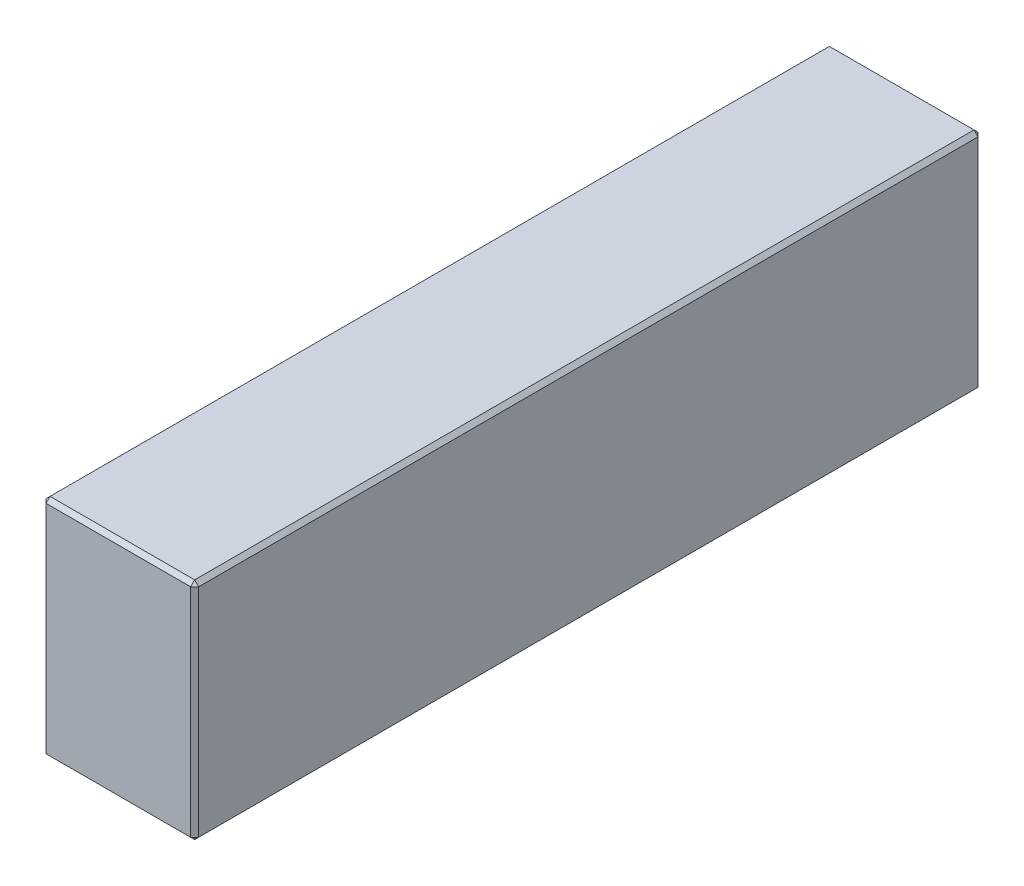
ISO-10303-21;
HEADER;
FILE_DESCRIPTION(('STEP AP214'),'2;1');
FILE_NAME('part.step','',(''),(''),'','','');
FILE_SCHEMA(('AUTOMOTIVE_DESIGN { 1 0 10303 214 1 1 1 1 }'));
ENDSEC;
DATA;
#1=APPLICATION_CONTEXT('core data for automotive mechanical design processes');
#2=APPLICATION_PROTOCOL_DEFINITION('international standard','automotive_design',2000,#1);
#3=PRODUCT_CONTEXT('',#1,'mechanical');
#4=PRODUCT('Part','Part','',(#3));
#5=PRODUCT_RELATED_PRODUCT_CATEGORY('part','',(#4));
#6=PRODUCT_DEFINITION_FORMATION('','',#4);
#7=PRODUCT_DEFINITION_CONTEXT('part definition',#1,'design');
#8=PRODUCT_DEFINITION('design','',#6,#7);
#9=PRODUCT_DEFINITION_SHAPE('','',#8);
#10=(LENGTH_UNIT() NAMED_UNIT(*) SI_UNIT(.MILLI.,.METRE.));
#11=(NAMED_UNIT(*) PLANE_ANGLE_UNIT() SI_UNIT($,.RADIAN.));
#12=(NAMED_UNIT(*) SI_UNIT($,.STERADIAN.) SOLID_ANGLE_UNIT());
#13=UNCERTAINTY_MEASURE_WITH_UNIT(LENGTH_MEASURE(1.E-05),#10,'distance_accuracy_value','');
#14=(GEOMETRIC_REPRESENTATION_CONTEXT(3) GLOBAL_UNCERTAINTY_ASSIGNED_CONTEXT((#13)) GLOBAL_UNIT_ASSIGNED_CONTEXT((#10,
#11,#12)) REPRESENTATION_CONTEXT('',''));
#15=CARTESIAN_POINT('',(0.,0.,0.));
#16=DIRECTION('',(0.,0.,1.));
#17=DIRECTION('',(1.,0.,0.));
#18=AXIS2_PLACEMENT_3D('',#15,#16,#17);
#19=CARTESIAN_POINT('',(-19.,56.,98.));
#20=DIRECTION('',(1.,0.,0.));
#21=DIRECTION('',(0.,0.,-1.));
#22=AXIS2_PLACEMENT_3D('',#19,#20,#21);
#23=PLANE('',#22);
#24=DIRECTION('',(0.,-1.,0.));
#25=VECTOR('',#24,1.);
#26=CARTESIAN_POINT('',(-19.,56.,-97.));
#27=LINE('',#26,#25);
#28=CARTESIAN_POINT('',(-19.,55.,-97.));
#29=VERTEX_POINT('',#28);
#30=CARTESIAN_POINT('',(-19.,1.00000000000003,-97.));
#31=VERTEX_POINT('',#30);
#32=EDGE_CURVE('E115',#29,#31,#27,.T.);
#33=ORIENTED_EDGE('',*,*,#32,.T.);
#34=DIRECTION('',(0.,0.,1.));
#35=VECTOR('',#34,1.);
#36=CARTESIAN_POINT('',(-19.,1.00000000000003,98.));
#37=LINE('',#36,#35);
#38=CARTESIAN_POINT('',(-19.,1.00000000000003,97.));
#39=VERTEX_POINT('',#38);
#40=EDGE_CURVE('E111',#31,#39,#37,.T.);
#41=ORIENTED_EDGE('',*,*,#40,.T.);
#42=DIRECTION('',(0.,1.,0.));
#43=VECTOR('',#42,1.);
#44=CARTESIAN_POINT('',(-19.,56.,97.));
#45=LINE('',#44,#43);
#46=CARTESIAN_POINT('',(-19.,55.,97.));
#47=VERTEX_POINT('',#46);
#48=EDGE_CURVE('E104',#39,#47,#45,.T.);
#49=ORIENTED_EDGE('',*,*,#48,.T.);
#50=DIRECTION('',(0.,0.,-1.));
#51=VECTOR('',#50,1.);
#52=CARTESIAN_POINT('',(-19.,55.,-98.));
#53=LINE('',#52,#51);
#54=EDGE_CURVE('E108',#47,#29,#53,.T.);
#55=ORIENTED_EDGE('',*,*,#54,.T.);
#56=EDGE_LOOP('',(#33,#41,#49,#55));
#57=FACE_BOUND('',#56,.T.);
#58=ADVANCED_FACE('F16',(#57),#23,.F.);
#59=CARTESIAN_POINT('',(19.,56.,98.));
#60=DIRECTION('',(0.,0.,-1.));
#61=DIRECTION('',(-1.,0.,0.));
#62=AXIS2_PLACEMENT_3D('',#59,#60,#61);
#63=PLANE('',#62);
#64=DIRECTION('',(-1.,0.,0.));
#65=VECTOR('',#64,1.);
#66=CARTESIAN_POINT('',(-19.,55.,98.));
#67=LINE('',#66,#65);
#68=CARTESIAN_POINT('',(18.,55.,98.));
#69=VERTEX_POINT('',#68);
#70=CARTESIAN_POINT('',(-18.,55.,98.));
#71=VERTEX_POINT('',#70);
#72=EDGE_CURVE('E165',#69,#71,#67,.T.);
#73=ORIENTED_EDGE('',*,*,#72,.T.);
#74=DIRECTION('',(0.,-1.,0.));
#75=VECTOR('',#74,1.);
#76=CARTESIAN_POINT('',(-18.,56.,98.));
#77=LINE('',#76,#75);
#78=CARTESIAN_POINT('',(-18.,1.,98.));
#79=VERTEX_POINT('',#78);
#80=EDGE_CURVE('E123',#71,#79,#77,.T.);
#81=ORIENTED_EDGE('',*,*,#80,.T.);
#82=DIRECTION('',(1.,0.,0.));
#83=VECTOR('',#82,1.);
#84=CARTESIAN_POINT('',(19.,1.,98.));
#85=LINE('',#84,#83);
#86=CARTESIAN_POINT('',(18.,1.,98.));
#87=VERTEX_POINT('',#86);
#88=EDGE_CURVE('E169',#79,#87,#85,.T.);
#89=ORIENTED_EDGE('',*,*,#88,.T.);
#90=DIRECTION('',(0.,1.,0.));
#91=VECTOR('',#90,1.);
#92=CARTESIAN_POINT('',(18.,56.,98.));
#93=LINE('',#92,#91);
#94=EDGE_CURVE('E167',#87,#69,#93,.T.);
#95=ORIENTED_EDGE('',*,*,#94,.T.);
#96=EDGE_LOOP('',(#73,#81,#89,#95));
#97=FACE_BOUND('',#96,.T.);
#98=ADVANCED_FACE('F276',(#97),#63,.F.);
#99=CARTESIAN_POINT('',(19.,56.,98.));
#100=DIRECTION('',(-1.,0.,0.));
#101=DIRECTION('',(0.,0.,1.));
#102=AXIS2_PLACEMENT_3D('',#99,#100,#101);
#103=PLANE('',#102);
#104=DIRECTION('',(0.,0.,-1.));
#105=VECTOR('',#104,1.);
#106=CARTESIAN_POINT('',(19.,1.,98.));
#107=LINE('',#106,#105);
#108=CARTESIAN_POINT('',(19.,1.,97.));
#109=VERTEX_POINT('',#108);
#110=CARTESIAN_POINT('',(19.,1.,-97.));
#111=VERTEX_POINT('',#110);
#112=EDGE_CURVE('E160',#109,#111,#107,.T.);
#113=ORIENTED_EDGE('',*,*,#112,.T.);
#114=DIRECTION('',(0.,1.,0.));
#115=VECTOR('',#114,1.);
#116=CARTESIAN_POINT('',(19.,56.,-97.));
#117=LINE('',#116,#115);
#118=CARTESIAN_POINT('',(19.,55.,-97.));
#119=VERTEX_POINT('',#118);
#120=EDGE_CURVE('E162',#111,#119,#117,.T.);
#121=ORIENTED_EDGE('',*,*,#120,.T.);
#122=DIRECTION('',(0.,0.,1.));
#123=VECTOR('',#122,1.);
#124=CARTESIAN_POINT('',(19.,55.,98.));
#125=LINE('',#124,#123);
#126=CARTESIAN_POINT('',(19.,55.,97.));
#127=VERTEX_POINT('',#126);
#128=EDGE_CURVE('E156',#119,#127,#125,.T.);
#129=ORIENTED_EDGE('',*,*,#128,.T.);
#130=DIRECTION('',(0.,-1.,0.));
#131=VECTOR('',#130,1.);
#132=CARTESIAN_POINT('',(19.,56.,97.));
#133=LINE('',#132,#131);
#134=EDGE_CURVE('E158',#127,#109,#133,.T.);
#135=ORIENTED_EDGE('',*,*,#134,.T.);
#136=EDGE_LOOP('',(#113,#121,#129,#135));
#137=FACE_BOUND('',#136,.T.);
#138=ADVANCED_FACE('F255',(#137),#103,.F.);
#139=CARTESIAN_POINT('',(19.,56.,-98.));
#140=DIRECTION('',(0.,0.,1.));
#141=DIRECTION('',(1.,0.,0.));
#142=AXIS2_PLACEMENT_3D('',#139,#140,#141);
#143=PLANE('',#142);
#144=DIRECTION('',(0.,-1.,0.));
#145=VECTOR('',#144,1.);
#146=CARTESIAN_POINT('',(18.,56.,-98.));
#147=LINE('',#146,#145);
#148=CARTESIAN_POINT('',(18.,55.,-98.));
#149=VERTEX_POINT('',#148);
#150=CARTESIAN_POINT('',(18.,1.,-98.));
#151=VERTEX_POINT('',#150);
#152=EDGE_CURVE('E149',#149,#151,#147,.T.);
#153=ORIENTED_EDGE('',*,*,#152,.T.);
#154=DIRECTION('',(-1.,0.,0.));
#155=VECTOR('',#154,1.);
#156=CARTESIAN_POINT('',(19.,1.,-98.));
#157=LINE('',#156,#155);
#158=CARTESIAN_POINT('',(-18.,1.,-98.));
#159=VERTEX_POINT('',#158);
#160=EDGE_CURVE('E154',#151,#159,#157,.T.);
#161=ORIENTED_EDGE('',*,*,#160,.T.);
#162=DIRECTION('',(0.,1.,0.));
#163=VECTOR('',#162,1.);
#164=CARTESIAN_POINT('',(-18.,56.,-98.));
#165=LINE('',#164,#163);
#166=CARTESIAN_POINT('',(-18.,55.,-98.));
#167=VERTEX_POINT('',#166);
#168=EDGE_CURVE('E151',#159,#167,#165,.T.);
#169=ORIENTED_EDGE('',*,*,#168,.T.);
#170=DIRECTION('',(1.,0.,0.));
#171=VECTOR('',#170,1.);
#172=CARTESIAN_POINT('',(19.,55.,-98.));
#173=LINE('',#172,#171);
#174=EDGE_CURVE('E147',#167,#149,#173,.T.);
#175=ORIENTED_EDGE('',*,*,#174,.T.);
#176=EDGE_LOOP('',(#153,#161,#169,#175));
#177=FACE_BOUND('',#176,.T.);
#178=ADVANCED_FACE('F285',(#177),#143,.F.);
#179=CARTESIAN_POINT('',(0.,56.,0.));
#180=DIRECTION('',(0.,1.,0.));
#181=DIRECTION('',(0.,0.,1.));
#182=AXIS2_PLACEMENT_3D('',#179,#180,#181);
#183=PLANE('',#182);
#184=DIRECTION('',(0.,0.,-1.));
#185=VECTOR('',#184,1.);
#186=CARTESIAN_POINT('',(18.,56.,-98.));
#187=LINE('',#186,#185);
#188=CARTESIAN_POINT('',(18.,56.,97.));
#189=VERTEX_POINT('',#188);
#190=CARTESIAN_POINT('',(18.,56.,-97.));
#191=VERTEX_POINT('',#190);
#192=EDGE_CURVE('E25',#189,#191,#187,.T.);
#193=ORIENTED_EDGE('',*,*,#192,.T.);
#194=DIRECTION('',(-1.,0.,0.));
#195=VECTOR('',#194,1.);
#196=CARTESIAN_POINT('',(-19.,56.,-97.));
#197=LINE('',#196,#195);
#198=CARTESIAN_POINT('',(-18.,56.,-97.));
#199=VERTEX_POINT('',#198);
#200=EDGE_CURVE('E10',#191,#199,#197,.T.);
#201=ORIENTED_EDGE('',*,*,#200,.T.);
#202=DIRECTION('',(0.,0.,1.));
#203=VECTOR('',#202,1.);
#204=CARTESIAN_POINT('',(-18.,56.,98.));
#205=LINE('',#204,#203);
#206=CARTESIAN_POINT('',(-18.,56.,97.));
#207=VERTEX_POINT('',#206);
#208=EDGE_CURVE('E181',#199,#207,#205,.T.);
#209=ORIENTED_EDGE('',*,*,#208,.T.);
#210=DIRECTION('',(1.,0.,0.));
#211=VECTOR('',#210,1.);
#212=CARTESIAN_POINT('',(19.,56.,97.));
#213=LINE('',#212,#211);
#214=EDGE_CURVE('E36',#207,#189,#213,.T.);
#215=ORIENTED_EDGE('',*,*,#214,.T.);
#216=EDGE_LOOP('',(#193,#201,#209,#215));
#217=FACE_BOUND('',#216,.T.);
#218=ADVANCED_FACE('F351',(#217),#183,.T.);
#219=CARTESIAN_POINT('',(0.,0.,0.));
#220=DIRECTION('',(0.,1.,0.));
#221=DIRECTION('',(0.,0.,1.));
#222=AXIS2_PLACEMENT_3D('',#219,#220,#221);
#223=PLANE('',#222);
#224=DIRECTION('',(0.,0.,1.));
#225=VECTOR('',#224,1.);
#226=CARTESIAN_POINT('',(18.,0.,0.));
#227=LINE('',#226,#225);
#228=CARTESIAN_POINT('',(18.,0.,-97.));
#229=VERTEX_POINT('',#228);
#230=CARTESIAN_POINT('',(18.,0.,97.));
#231=VERTEX_POINT('',#230);
#232=EDGE_CURVE('E172',#229,#231,#227,.T.);
#233=ORIENTED_EDGE('',*,*,#232,.T.);
#234=DIRECTION('',(-1.,0.,0.));
#235=VECTOR('',#234,1.);
#236=CARTESIAN_POINT('',(0.,0.,97.));
#237=LINE('',#236,#235);
#238=CARTESIAN_POINT('',(-18.,0.,97.));
#239=VERTEX_POINT('',#238);
#240=EDGE_CURVE('E178',#231,#239,#237,.T.);
#241=ORIENTED_EDGE('',*,*,#240,.T.);
#242=DIRECTION('',(0.,0.,-1.));
#243=VECTOR('',#242,1.);
#244=CARTESIAN_POINT('',(-18.,0.,0.));
#245=LINE('',#244,#243);
#246=CARTESIAN_POINT('',(-18.,0.,-97.));
#247=VERTEX_POINT('',#246);
#248=EDGE_CURVE('E176',#239,#247,#245,.T.);
#249=ORIENTED_EDGE('',*,*,#248,.T.);
#250=DIRECTION('',(1.,0.,0.));
#251=VECTOR('',#250,1.);
#252=CARTESIAN_POINT('',(0.,0.,-97.));
#253=LINE('',#252,#251);
#254=EDGE_CURVE('E174',#247,#229,#253,.T.);
#255=ORIENTED_EDGE('',*,*,#254,.T.);
#256=EDGE_LOOP('',(#233,#241,#249,#255));
#257=FACE_BOUND('',#256,.T.);
#258=ADVANCED_FACE('F247',(#257),#223,.F.);
#259=CARTESIAN_POINT('',(19.,56.,97.));
#260=DIRECTION('',(-0.707106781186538,0.,-0.707106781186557));
#261=DIRECTION('',(0.,-1.,0.));
#262=AXIS2_PLACEMENT_3D('',#259,#260,#261);
#263=PLANE('',#262);
#264=DIRECTION('',(-0.707106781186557,0.,0.707106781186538));
#265=VECTOR('',#264,1.);
#266=CARTESIAN_POINT('',(18.,55.,98.));
#267=LINE('',#266,#265);
#268=EDGE_CURVE('E20',#69,#127,#267,.F.);
#269=ORIENTED_EDGE('',*,*,#268,.F.);
#270=ORIENTED_EDGE('',*,*,#94,.F.);
#271=DIRECTION('',(0.707106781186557,0.,-0.707106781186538));
#272=VECTOR('',#271,1.);
#273=CARTESIAN_POINT('',(18.,1.,98.));
#274=LINE('',#273,#272);
#275=EDGE_CURVE('E143',#109,#87,#274,.F.);
#276=ORIENTED_EDGE('',*,*,#275,.F.);
#277=ORIENTED_EDGE('',*,*,#134,.F.);
#278=EDGE_LOOP('',(#269,#270,#276,#277));
#279=FACE_BOUND('',#278,.T.);
#280=ADVANCED_FACE('F18',(#279),#263,.F.);
#281=CARTESIAN_POINT('',(18.,55.,98.));
#282=DIRECTION('',(0.577350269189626,0.57735026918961,0.577350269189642));
#283=DIRECTION('',(0.707106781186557,0.,-0.707106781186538));
#284=AXIS2_PLACEMENT_3D('',#281,#282,#283);
#285=PLANE('',#284);
#286=DIRECTION('',(0.,-0.707106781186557,0.707106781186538));
#287=VECTOR('',#286,1.);
#288=CARTESIAN_POINT('',(18.,55.,98.));
#289=LINE('',#288,#287);
#290=EDGE_CURVE('E227',#69,#189,#289,.F.);
#291=ORIENTED_EDGE('',*,*,#290,.F.);
#292=ORIENTED_EDGE('',*,*,#268,.T.);
#293=DIRECTION('',(-0.707106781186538,0.707106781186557,0.));
#294=VECTOR('',#293,1.);
#295=CARTESIAN_POINT('',(18.5,55.5,97.));
#296=LINE('',#295,#294);
#297=EDGE_CURVE('E229',#189,#127,#296,.F.);
#298=ORIENTED_EDGE('',*,*,#297,.F.);
#299=EDGE_LOOP('',(#291,#292,#298));
#300=FACE_BOUND('',#299,.T.);
#301=ADVANCED_FACE('F271',(#300),#285,.T.);
#302=CARTESIAN_POINT('',(18.,1.,98.));
#303=DIRECTION('',(0.57735026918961,-0.577350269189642,0.577350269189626));
#304=DIRECTION('',(0.,-0.707106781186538,-0.707106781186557));
#305=AXIS2_PLACEMENT_3D('',#302,#303,#304);
#306=PLANE('',#305);
#307=DIRECTION('',(-0.707106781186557,-0.707106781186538,0.));
#308=VECTOR('',#307,1.);
#309=CARTESIAN_POINT('',(18.5,0.5,97.));
#310=LINE('',#309,#308);
#311=EDGE_CURVE('E221',#109,#231,#310,.T.);
#312=ORIENTED_EDGE('',*,*,#311,.F.);
#313=ORIENTED_EDGE('',*,*,#275,.T.);
#314=DIRECTION('',(0.,0.707106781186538,0.707106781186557));
#315=VECTOR('',#314,1.);
#316=CARTESIAN_POINT('',(18.,1.,98.));
#317=LINE('',#316,#315);
#318=EDGE_CURVE('E224',#231,#87,#317,.T.);
#319=ORIENTED_EDGE('',*,*,#318,.F.);
#320=EDGE_LOOP('',(#312,#313,#319));
#321=FACE_BOUND('',#320,.T.);
#322=ADVANCED_FACE('F236',(#321),#306,.T.);
#323=CARTESIAN_POINT('',(18.,56.,0.));
#324=DIRECTION('',(0.707106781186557,0.707106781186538,0.));
#325=DIRECTION('',(0.,0.,1.));
#326=AXIS2_PLACEMENT_3D('',#323,#324,#325);
#327=PLANE('',#326);
#328=ORIENTED_EDGE('',*,*,#297,.T.);
#329=ORIENTED_EDGE('',*,*,#128,.F.);
#330=DIRECTION('',(0.707106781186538,-0.707106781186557,0.));
#331=VECTOR('',#330,1.);
#332=CARTESIAN_POINT('',(19.,55.,-97.));
#333=LINE('',#332,#331);
#334=EDGE_CURVE('E216',#191,#119,#333,.T.);
#335=ORIENTED_EDGE('',*,*,#334,.F.);
#336=ORIENTED_EDGE('',*,*,#192,.F.);
#337=EDGE_LOOP('',(#328,#329,#335,#336));
#338=FACE_BOUND('',#337,.T.);
#339=ADVANCED_FACE('F266',(#338),#327,.T.);
#340=CARTESIAN_POINT('',(0.,56.,97.));
#341=DIRECTION('',(0.,0.707106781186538,0.707106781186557));
#342=DIRECTION('',(-1.,0.,0.));
#343=AXIS2_PLACEMENT_3D('',#340,#341,#342);
#344=PLANE('',#343);
#345=ORIENTED_EDGE('',*,*,#290,.T.);
#346=ORIENTED_EDGE('',*,*,#214,.F.);
#347=DIRECTION('',(0.,0.707106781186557,-0.707106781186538));
#348=VECTOR('',#347,1.);
#349=CARTESIAN_POINT('',(-18.,55.5,97.5));
#350=LINE('',#349,#348);
#351=EDGE_CURVE('E127',#71,#207,#350,.T.);
#352=ORIENTED_EDGE('',*,*,#351,.F.);
#353=ORIENTED_EDGE('',*,*,#72,.F.);
#354=EDGE_LOOP('',(#345,#346,#352,#353));
#355=FACE_BOUND('',#354,.T.);
#356=ADVANCED_FACE('F274',(#355),#344,.T.);
#357=CARTESIAN_POINT('',(-18.,56.,98.));
#358=DIRECTION('',(0.707106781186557,0.,-0.707106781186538));
#359=DIRECTION('',(0.,-1.,0.));
#360=AXIS2_PLACEMENT_3D('',#357,#358,#359);
#361=PLANE('',#360);
#362=DIRECTION('',(0.707106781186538,0.,0.707106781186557));
#363=VECTOR('',#362,1.);
#364=CARTESIAN_POINT('',(-18.,1.,98.));
#365=LINE('',#364,#363);
#366=EDGE_CURVE('E128',#79,#39,#365,.F.);
#367=ORIENTED_EDGE('',*,*,#366,.F.);
#368=ORIENTED_EDGE('',*,*,#80,.F.);
#369=DIRECTION('',(-0.707106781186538,0.,-0.707106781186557));
#370=VECTOR('',#369,1.);
#371=CARTESIAN_POINT('',(-19.,55.,97.));
#372=LINE('',#371,#370);
#373=EDGE_CURVE('E119',#47,#71,#372,.F.);
#374=ORIENTED_EDGE('',*,*,#373,.F.);
#375=ORIENTED_EDGE('',*,*,#48,.F.);
#376=EDGE_LOOP('',(#367,#368,#374,#375));
#377=FACE_BOUND('',#376,.T.);
#378=ADVANCED_FACE('F121',(#377),#361,.F.);
#379=CARTESIAN_POINT('',(19.,1.,98.));
#380=DIRECTION('',(0.,0.707106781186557,-0.707106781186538));
#381=DIRECTION('',(1.,0.,0.));
#382=AXIS2_PLACEMENT_3D('',#379,#380,#381);
#383=PLANE('',#382);
#384=ORIENTED_EDGE('',*,*,#318,.T.);
#385=ORIENTED_EDGE('',*,*,#88,.F.);
#386=DIRECTION('',(0.,-0.707106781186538,-0.707106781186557));
#387=VECTOR('',#386,1.);
#388=CARTESIAN_POINT('',(-18.,1.,98.));
#389=LINE('',#388,#387);
#390=EDGE_CURVE('E212',#239,#79,#389,.F.);
#391=ORIENTED_EDGE('',*,*,#390,.F.);
#392=ORIENTED_EDGE('',*,*,#240,.F.);
#393=EDGE_LOOP('',(#384,#385,#391,#392));
#394=FACE_BOUND('',#393,.T.);
#395=ADVANCED_FACE('F244',(#394),#383,.F.);
#396=CARTESIAN_POINT('',(19.,1.,98.));
#397=DIRECTION('',(-0.707106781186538,0.707106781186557,0.));
#398=DIRECTION('',(0.,0.,-1.));
#399=AXIS2_PLACEMENT_3D('',#396,#397,#398);
#400=PLANE('',#399);
#401=ORIENTED_EDGE('',*,*,#311,.T.);
#402=ORIENTED_EDGE('',*,*,#232,.F.);
#403=DIRECTION('',(0.707106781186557,0.707106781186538,0.));
#404=VECTOR('',#403,1.);
#405=CARTESIAN_POINT('',(18.5,0.5,-97.));
#406=LINE('',#405,#404);
#407=EDGE_CURVE('E209',#111,#229,#406,.F.);
#408=ORIENTED_EDGE('',*,*,#407,.F.);
#409=ORIENTED_EDGE('',*,*,#112,.F.);
#410=EDGE_LOOP('',(#401,#402,#408,#409));
#411=FACE_BOUND('',#410,.T.);
#412=ADVANCED_FACE('F252',(#411),#400,.F.);
#413=CARTESIAN_POINT('',(18.,56.,-98.));
#414=DIRECTION('',(-0.707106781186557,0.,0.707106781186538));
#415=DIRECTION('',(0.,-1.,0.));
#416=AXIS2_PLACEMENT_3D('',#413,#414,#415);
#417=PLANE('',#416);
#418=DIRECTION('',(0.707106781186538,0.,0.707106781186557));
#419=VECTOR('',#418,1.);
#420=CARTESIAN_POINT('',(19.,55.,-97.));
#421=LINE('',#420,#419);
#422=EDGE_CURVE('E218',#119,#149,#421,.F.);
#423=ORIENTED_EDGE('',*,*,#422,.F.);
#424=ORIENTED_EDGE('',*,*,#120,.F.);
#425=DIRECTION('',(-0.707106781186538,0.,-0.707106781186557));
#426=VECTOR('',#425,1.);
#427=CARTESIAN_POINT('',(18.,1.,-98.));
#428=LINE('',#427,#426);
#429=EDGE_CURVE('E206',#151,#111,#428,.F.);
#430=ORIENTED_EDGE('',*,*,#429,.F.);
#431=ORIENTED_EDGE('',*,*,#152,.F.);
#432=EDGE_LOOP('',(#423,#424,#430,#431));
#433=FACE_BOUND('',#432,.T.);
#434=ADVANCED_FACE('F259',(#433),#417,.F.);
#435=CARTESIAN_POINT('',(19.,55.,-97.));
#436=DIRECTION('',(0.577350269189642,0.57735026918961,-0.577350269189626));
#437=DIRECTION('',(-0.707106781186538,0.,-0.707106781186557));
#438=AXIS2_PLACEMENT_3D('',#435,#436,#437);
#439=PLANE('',#438);
#440=ORIENTED_EDGE('',*,*,#334,.T.);
#441=ORIENTED_EDGE('',*,*,#422,.T.);
#442=DIRECTION('',(0.,0.707106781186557,0.707106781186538));
#443=VECTOR('',#442,1.);
#444=CARTESIAN_POINT('',(18.,55.5,-97.5));
#445=LINE('',#444,#443);
#446=EDGE_CURVE('E135',#191,#149,#445,.F.);
#447=ORIENTED_EDGE('',*,*,#446,.F.);
#448=EDGE_LOOP('',(#440,#441,#447));
#449=FACE_BOUND('',#448,.T.);
#450=ADVANCED_FACE('F326',(#449),#439,.T.);
#451=CARTESIAN_POINT('',(-19.,55.,97.));
#452=DIRECTION('',(-0.577350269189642,0.57735026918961,0.577350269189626));
#453=DIRECTION('',(0.707106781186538,0.,0.707106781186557));
#454=AXIS2_PLACEMENT_3D('',#451,#452,#453);
#455=PLANE('',#454);
#456=ORIENTED_EDGE('',*,*,#373,.T.);
#457=ORIENTED_EDGE('',*,*,#351,.T.);
#458=DIRECTION('',(-0.707106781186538,-0.707106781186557,0.));
#459=VECTOR('',#458,1.);
#460=CARTESIAN_POINT('',(-19.,55.,97.));
#461=LINE('',#460,#459);
#462=EDGE_CURVE('E131',#47,#207,#461,.F.);
#463=ORIENTED_EDGE('',*,*,#462,.F.);
#464=EDGE_LOOP('',(#456,#457,#463));
#465=FACE_BOUND('',#464,.T.);
#466=ADVANCED_FACE('F132',(#465),#455,.T.);
#467=CARTESIAN_POINT('',(-18.,1.,98.));
#468=DIRECTION('',(-0.577350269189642,-0.577350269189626,0.57735026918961));
#469=DIRECTION('',(0.707106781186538,-0.707106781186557,0.));
#470=AXIS2_PLACEMENT_3D('',#467,#468,#469);
#471=PLANE('',#470);
#472=ORIENTED_EDGE('',*,*,#390,.T.);
#473=ORIENTED_EDGE('',*,*,#366,.T.);
#474=DIRECTION('',(-0.707106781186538,0.707106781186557,0.));
#475=VECTOR('',#474,1.);
#476=CARTESIAN_POINT('',(-18.5,0.500000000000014,97.));
#477=LINE('',#476,#475);
#478=EDGE_CURVE('E136',#239,#39,#477,.T.);
#479=ORIENTED_EDGE('',*,*,#478,.F.);
#480=EDGE_LOOP('',(#472,#473,#479));
#481=FACE_BOUND('',#480,.T.);
#482=ADVANCED_FACE('F319',(#481),#471,.T.);
#483=CARTESIAN_POINT('',(18.,1.,-98.));
#484=DIRECTION('',(0.577350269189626,-0.577350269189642,-0.57735026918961));
#485=DIRECTION('',(0.707106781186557,0.707106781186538,0.));
#486=AXIS2_PLACEMENT_3D('',#483,#484,#485);
#487=PLANE('',#486);
#488=ORIENTED_EDGE('',*,*,#429,.T.);
#489=ORIENTED_EDGE('',*,*,#407,.T.);
#490=DIRECTION('',(0.,-0.707106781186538,0.707106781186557));
#491=VECTOR('',#490,1.);
#492=CARTESIAN_POINT('',(18.,1.,-98.));
#493=LINE('',#492,#491);
#494=EDGE_CURVE('E199',#151,#229,#493,.T.);
#495=ORIENTED_EDGE('',*,*,#494,.F.);
#496=EDGE_LOOP('',(#488,#489,#495));
#497=FACE_BOUND('',#496,.T.);
#498=ADVANCED_FACE('F315',(#497),#487,.T.);
#499=CARTESIAN_POINT('',(0.,56.,-97.));
#500=DIRECTION('',(0.,0.707106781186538,-0.707106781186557));
#501=DIRECTION('',(1.,0.,0.));
#502=AXIS2_PLACEMENT_3D('',#499,#500,#501);
#503=PLANE('',#502);
#504=ORIENTED_EDGE('',*,*,#446,.T.);
#505=ORIENTED_EDGE('',*,*,#174,.F.);
#506=DIRECTION('',(0.,-0.707106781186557,-0.707106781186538));
#507=VECTOR('',#506,1.);
#508=CARTESIAN_POINT('',(-18.,55.,-98.));
#509=LINE('',#508,#507);
#510=EDGE_CURVE('E196',#199,#167,#509,.T.);
#511=ORIENTED_EDGE('',*,*,#510,.F.);
#512=ORIENTED_EDGE('',*,*,#200,.F.);
#513=EDGE_LOOP('',(#504,#505,#511,#512));
#514=FACE_BOUND('',#513,.T.);
#515=ADVANCED_FACE('F312',(#514),#503,.T.);
#516=CARTESIAN_POINT('',(-18.,56.,0.));
#517=DIRECTION('',(-0.707106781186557,0.707106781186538,0.));
#518=DIRECTION('',(0.,0.,-1.));
#519=AXIS2_PLACEMENT_3D('',#516,#517,#518);
#520=PLANE('',#519);
#521=ORIENTED_EDGE('',*,*,#462,.T.);
#522=ORIENTED_EDGE('',*,*,#208,.F.);
#523=DIRECTION('',(0.707106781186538,0.707106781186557,0.));
#524=VECTOR('',#523,1.);
#525=CARTESIAN_POINT('',(-18.5,55.5,-97.));
#526=LINE('',#525,#524);
#527=EDGE_CURVE('E139',#29,#199,#526,.T.);
#528=ORIENTED_EDGE('',*,*,#527,.F.);
#529=ORIENTED_EDGE('',*,*,#54,.F.);
#530=EDGE_LOOP('',(#521,#522,#528,#529));
#531=FACE_BOUND('',#530,.T.);
#532=ADVANCED_FACE('F138',(#531),#520,.T.);
#533=CARTESIAN_POINT('',(-19.,1.00000000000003,98.));
#534=DIRECTION('',(0.707106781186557,0.707106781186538,0.));
#535=DIRECTION('',(0.,0.,1.));
#536=AXIS2_PLACEMENT_3D('',#533,#534,#535);
#537=PLANE('',#536);
#538=ORIENTED_EDGE('',*,*,#478,.T.);
#539=ORIENTED_EDGE('',*,*,#40,.F.);
#540=DIRECTION('',(0.707106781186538,-0.707106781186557,0.));
#541=VECTOR('',#540,1.);
#542=CARTESIAN_POINT('',(-19.,1.00000000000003,-97.));
#543=LINE('',#542,#541);
#544=EDGE_CURVE('E192',#247,#31,#543,.F.);
#545=ORIENTED_EDGE('',*,*,#544,.F.);
#546=ORIENTED_EDGE('',*,*,#248,.F.);
#547=EDGE_LOOP('',(#538,#539,#545,#546));
#548=FACE_BOUND('',#547,.T.);
#549=ADVANCED_FACE('F305',(#548),#537,.F.);
#550=CARTESIAN_POINT('',(19.,1.,-98.));
#551=DIRECTION('',(0.,0.707106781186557,0.707106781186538));
#552=DIRECTION('',(-1.,0.,0.));
#553=AXIS2_PLACEMENT_3D('',#550,#551,#552);
#554=PLANE('',#553);
#555=ORIENTED_EDGE('',*,*,#494,.T.);
#556=ORIENTED_EDGE('',*,*,#254,.F.);
#557=DIRECTION('',(0.,0.707106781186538,-0.707106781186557));
#558=VECTOR('',#557,1.);
#559=CARTESIAN_POINT('',(-18.,0.5,-97.5));
#560=LINE('',#559,#558);
#561=EDGE_CURVE('E189',#159,#247,#560,.F.);
#562=ORIENTED_EDGE('',*,*,#561,.F.);
#563=ORIENTED_EDGE('',*,*,#160,.F.);
#564=EDGE_LOOP('',(#555,#556,#562,#563));
#565=FACE_BOUND('',#564,.T.);
#566=ADVANCED_FACE('F301',(#565),#554,.F.);
#567=CARTESIAN_POINT('',(-18.,55.,-98.));
#568=DIRECTION('',(-0.577350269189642,0.57735026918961,-0.577350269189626));
#569=DIRECTION('',(-0.707106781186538,0.,0.707106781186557));
#570=AXIS2_PLACEMENT_3D('',#567,#568,#569);
#571=PLANE('',#570);
#572=ORIENTED_EDGE('',*,*,#527,.T.);
#573=ORIENTED_EDGE('',*,*,#510,.T.);
#574=DIRECTION('',(0.707106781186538,0.,-0.707106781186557));
#575=VECTOR('',#574,1.);
#576=CARTESIAN_POINT('',(-18.,55.,-98.));
#577=LINE('',#576,#575);
#578=EDGE_CURVE('E187',#29,#167,#577,.T.);
#579=ORIENTED_EDGE('',*,*,#578,.F.);
#580=EDGE_LOOP('',(#572,#573,#579));
#581=FACE_BOUND('',#580,.T.);
#582=ADVANCED_FACE('F297',(#581),#571,.T.);
#583=CARTESIAN_POINT('',(-19.,1.00000000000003,-97.));
#584=DIRECTION('',(-0.577350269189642,-0.577350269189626,-0.57735026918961));
#585=DIRECTION('',(0.707106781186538,-0.707106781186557,0.));
#586=AXIS2_PLACEMENT_3D('',#583,#584,#585);
#587=PLANE('',#586);
#588=ORIENTED_EDGE('',*,*,#561,.T.);
#589=ORIENTED_EDGE('',*,*,#544,.T.);
#590=DIRECTION('',(-0.707106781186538,0.,0.707106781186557));
#591=VECTOR('',#590,1.);
#592=CARTESIAN_POINT('',(-19.,1.00000000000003,-97.));
#593=LINE('',#592,#591);
#594=EDGE_CURVE('E185',#159,#31,#593,.T.);
#595=ORIENTED_EDGE('',*,*,#594,.F.);
#596=EDGE_LOOP('',(#588,#589,#595));
#597=FACE_BOUND('',#596,.T.);
#598=ADVANCED_FACE('F293',(#597),#587,.T.);
#599=CARTESIAN_POINT('',(-19.,56.,-97.));
#600=DIRECTION('',(0.707106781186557,0.,0.707106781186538));
#601=DIRECTION('',(0.,-1.,0.));
#602=AXIS2_PLACEMENT_3D('',#599,#600,#601);
#603=PLANE('',#602);
#604=ORIENTED_EDGE('',*,*,#578,.T.);
#605=ORIENTED_EDGE('',*,*,#168,.F.);
#606=ORIENTED_EDGE('',*,*,#594,.T.);
#607=ORIENTED_EDGE('',*,*,#32,.F.);
#608=EDGE_LOOP('',(#604,#605,#606,#607));
#609=FACE_BOUND('',#608,.T.);
#610=ADVANCED_FACE('F290',(#609),#603,.F.);
#611=CLOSED_SHELL('',(#58,#98,#138,#178,#218,#258,#280,#301,#322,#339,#356,#378,#395,#412,#434,
#450,#466,#482,#498,#515,#532,#549,#566,#582,#598,#610));
#612=MANIFOLD_SOLID_BREP('B1',#611);
#613=ADVANCED_BREP_SHAPE_REPRESENTATION('',(#18,#612),#14);
#614=SHAPE_DEFINITION_REPRESENTATION(#9,#613);
ENDSEC;
END-ISO-10303-21;
